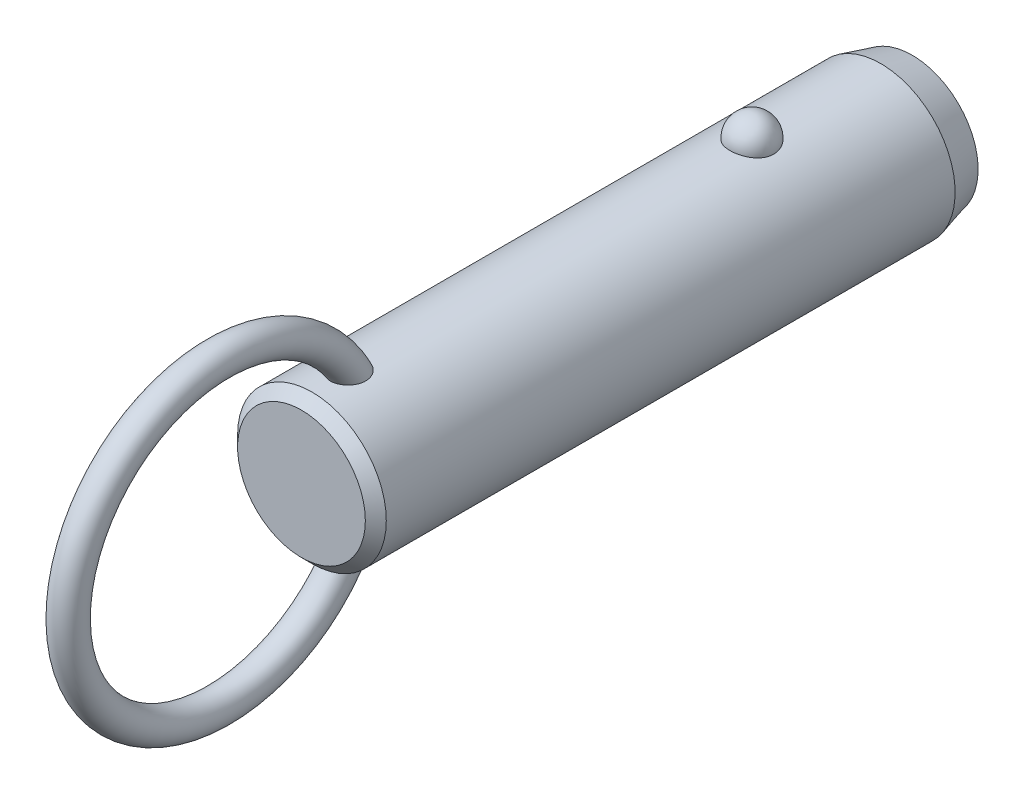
ISO-10303-21;
HEADER;
FILE_DESCRIPTION(('STEP AP214'),'2;1');
FILE_NAME('part.step','',(''),(''),'','','');
FILE_SCHEMA(('AUTOMOTIVE_DESIGN { 1 0 10303 214 1 1 1 1 }'));
ENDSEC;
DATA;
#1=APPLICATION_CONTEXT('core data for automotive mechanical design processes');
#2=APPLICATION_PROTOCOL_DEFINITION('international standard','automotive_design',2000,#1);
#3=PRODUCT_CONTEXT('',#1,'mechanical');
#4=PRODUCT('Part','Part','',(#3));
#5=PRODUCT_RELATED_PRODUCT_CATEGORY('part','',(#4));
#6=PRODUCT_DEFINITION_FORMATION('','',#4);
#7=PRODUCT_DEFINITION_CONTEXT('part definition',#1,'design');
#8=PRODUCT_DEFINITION('design','',#6,#7);
#9=PRODUCT_DEFINITION_SHAPE('','',#8);
#10=(LENGTH_UNIT() NAMED_UNIT(*) SI_UNIT(.MILLI.,.METRE.));
#11=(NAMED_UNIT(*) PLANE_ANGLE_UNIT() SI_UNIT($,.RADIAN.));
#12=(NAMED_UNIT(*) SI_UNIT($,.STERADIAN.) SOLID_ANGLE_UNIT());
#13=UNCERTAINTY_MEASURE_WITH_UNIT(LENGTH_MEASURE(1.E-05),#10,'distance_accuracy_value','');
#14=(GEOMETRIC_REPRESENTATION_CONTEXT(3) GLOBAL_UNCERTAINTY_ASSIGNED_CONTEXT((#13)) GLOBAL_UNIT_ASSIGNED_CONTEXT((#10,
#11,#12)) REPRESENTATION_CONTEXT('',''));
#15=CARTESIAN_POINT('',(0.,0.,0.));
#16=DIRECTION('',(0.,0.,1.));
#17=DIRECTION('',(1.,0.,0.));
#18=AXIS2_PLACEMENT_3D('',#15,#16,#17);
#19=CARTESIAN_POINT('',(0.,0.,33.));
#20=DIRECTION('',(0.,0.,-1.));
#21=DIRECTION('',(-1.,0.,0.));
#22=AXIS2_PLACEMENT_3D('',#19,#20,#21);
#23=CYLINDRICAL_SURFACE('',#22,7.1);
#24=CARTESIAN_POINT('',(2.0769088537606,6.78943661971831,-2.1));
#25=CARTESIAN_POINT('',(2.07690739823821,6.78943796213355,-1.98268154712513));
#26=CARTESIAN_POINT('',(2.06738130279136,6.79237331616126,-1.86534506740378));
#27=CARTESIAN_POINT('',(2.0295040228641,6.8037853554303,-1.63400788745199));
#28=CARTESIAN_POINT('',(2.00114757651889,6.81226358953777,-1.52000812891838));
#29=CARTESIAN_POINT('',(1.92632025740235,6.83379798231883,-1.29863433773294));
#30=CARTESIAN_POINT('',(1.87985726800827,6.84685214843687,-1.19125744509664));
#31=CARTESIAN_POINT('',(1.76995205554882,6.87608091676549,-0.98604657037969));
#32=CARTESIAN_POINT('',(1.70650980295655,6.8922555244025,-0.88821260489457));
#33=CARTESIAN_POINT('',(1.5638119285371,6.92602930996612,-0.704242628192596));
#34=CARTESIAN_POINT('',(1.4844714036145,6.94363582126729,-0.618173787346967));
#35=CARTESIAN_POINT('',(1.31221746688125,6.97823658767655,-0.460740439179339));
#36=CARTESIAN_POINT('',(1.21930409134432,6.99523084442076,-0.389375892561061));
#37=CARTESIAN_POINT('',(1.02268781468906,7.02666176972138,-0.263547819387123));
#38=CARTESIAN_POINT('',(0.91902009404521,7.04110638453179,-0.209031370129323));
#39=CARTESIAN_POINT('',(0.703548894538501,7.06588726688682,-0.118163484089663));
#40=CARTESIAN_POINT('',(0.591746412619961,7.07622403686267,-0.0818098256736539));
#41=CARTESIAN_POINT('',(0.365557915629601,7.09147068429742,-0.0288711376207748));
#42=CARTESIAN_POINT('',(0.251267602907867,7.09648447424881,-0.0119070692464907));
#43=CARTESIAN_POINT('',(0.0213499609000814,7.10089837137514,0.00304925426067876));
#44=CARTESIAN_POINT('',(-0.0942772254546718,7.10029907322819,0.00104351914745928));
#45=CARTESIAN_POINT('',(-0.321651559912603,7.09360829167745,-0.0216931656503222));
#46=CARTESIAN_POINT('',(-0.433431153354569,7.08760388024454,-0.0421272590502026));
#47=CARTESIAN_POINT('',(-0.651862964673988,7.07086131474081,-0.100729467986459));
#48=CARTESIAN_POINT('',(-0.758515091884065,7.06012307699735,-0.138897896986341));
#49=CARTESIAN_POINT('',(-0.964449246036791,7.03496097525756,-0.232213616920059));
#50=CARTESIAN_POINT('',(-1.06368095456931,7.02051445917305,-0.287465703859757));
#51=CARTESIAN_POINT('',(-1.25145353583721,6.98948740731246,-0.413383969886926));
#52=CARTESIAN_POINT('',(-1.33999321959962,6.97290663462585,-0.48405186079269));
#53=CARTESIAN_POINT('',(-1.50591604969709,6.93898770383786,-0.640594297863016));
#54=CARTESIAN_POINT('',(-1.58302488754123,6.92164094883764,-0.726757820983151));
#55=CARTESIAN_POINT('',(-1.72189320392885,6.8884103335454,-0.91092752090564));
#56=CARTESIAN_POINT('',(-1.78365144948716,6.87252659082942,-1.008934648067));
#57=CARTESIAN_POINT('',(-1.89101272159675,6.84377189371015,-1.21549497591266));
#58=CARTESIAN_POINT('',(-1.93639553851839,6.83094274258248,-1.32416860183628));
#59=CARTESIAN_POINT('',(-2.00874275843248,6.81002070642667,-1.54791500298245));
#60=CARTESIAN_POINT('',(-2.03570774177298,6.80192767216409,-1.66298757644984));
#61=CARTESIAN_POINT('',(-2.07047276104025,6.7914266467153,-1.89571453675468));
#62=CARTESIAN_POINT('',(-2.07835878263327,6.78899315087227,-2.01335491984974));
#63=CARTESIAN_POINT('',(-2.07502083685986,6.79001409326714,-2.24833570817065));
#64=CARTESIAN_POINT('',(-2.06379746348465,6.7934683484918,-2.36567612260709));
#65=CARTESIAN_POINT('',(-2.02263913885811,6.80583442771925,-2.59603194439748));
#66=CARTESIAN_POINT('',(-1.99281127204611,6.81471501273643,-2.70906820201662));
#67=CARTESIAN_POINT('',(-1.91526639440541,6.83691232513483,-2.92836575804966));
#68=CARTESIAN_POINT('',(-1.8675486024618,6.85022924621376,-3.03462676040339));
#69=CARTESIAN_POINT('',(-1.75504492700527,6.87991336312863,-3.23806487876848));
#70=CARTESIAN_POINT('',(-1.69015924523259,6.89629822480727,-3.33518422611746));
#71=CARTESIAN_POINT('',(-1.54505404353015,6.93024852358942,-3.51697105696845));
#72=CARTESIAN_POINT('',(-1.46483385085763,6.94781401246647,-3.60163799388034));
#73=CARTESIAN_POINT('',(-1.29071406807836,6.98225977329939,-3.75654119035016));
#74=CARTESIAN_POINT('',(-1.19675650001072,6.99913673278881,-3.82671308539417));
#75=CARTESIAN_POINT('',(-0.997940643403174,7.03023618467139,-3.9501837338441));
#76=CARTESIAN_POINT('',(-0.89308318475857,7.04445887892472,-4.00348377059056));
#77=CARTESIAN_POINT('',(-0.676902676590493,7.06848365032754,-4.09107242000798));
#78=CARTESIAN_POINT('',(-0.565686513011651,7.0783430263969,-4.12560889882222));
#79=CARTESIAN_POINT('',(-0.338739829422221,7.09282534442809,-4.17575450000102));
#80=CARTESIAN_POINT('',(-0.223009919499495,7.09744899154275,-4.19136617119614));
#81=CARTESIAN_POINT('',(0.00707628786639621,7.10090930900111,-4.20307965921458));
#82=CARTESIAN_POINT('',(0.121410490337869,7.09986531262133,-4.19958377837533));
#83=CARTESIAN_POINT('',(0.347815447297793,7.092380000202,-4.17411564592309));
#84=CARTESIAN_POINT('',(0.459886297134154,7.08593891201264,-4.15214417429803));
#85=CARTESIAN_POINT('',(0.678084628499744,7.06838983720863,-4.09049562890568));
#86=CARTESIAN_POINT('',(0.784237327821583,7.05730369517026,-4.05090137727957));
#87=CARTESIAN_POINT('',(0.988305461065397,7.03163139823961,-3.95511447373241));
#88=CARTESIAN_POINT('',(1.08622031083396,7.01704499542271,-3.89892064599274));
#89=CARTESIAN_POINT('',(1.27284490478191,6.98562668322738,-3.77035541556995));
#90=CARTESIAN_POINT('',(1.36137372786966,6.96876135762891,-3.69772964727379));
#91=CARTESIAN_POINT('',(1.52509486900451,6.93477412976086,-3.53878279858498));
#92=CARTESIAN_POINT('',(1.60028496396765,6.91765218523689,-3.45245943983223));
#93=CARTESIAN_POINT('',(1.73681688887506,6.88465753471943,-3.26658774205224));
#94=CARTESIAN_POINT('',(1.79785966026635,6.86881574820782,-3.16681408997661));
#95=CARTESIAN_POINT('',(1.90265327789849,6.84053157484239,-2.95814408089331));
#96=CARTESIAN_POINT('',(1.94640861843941,6.82808830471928,-2.84925010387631));
#97=CARTESIAN_POINT('',(2.01274378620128,6.80881460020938,-2.63454318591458));
#98=CARTESIAN_POINT('',(2.03676193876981,6.80160856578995,-2.52920574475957));
#99=CARTESIAN_POINT('',(2.06884490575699,6.79191902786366,-2.3159172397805));
#100=CARTESIAN_POINT('',(2.07691019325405,6.78943538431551,-2.20796625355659));
#101=CARTESIAN_POINT('',(2.0769088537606,6.78943661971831,-2.1));
#102=B_SPLINE_CURVE_WITH_KNOTS('',3,(#24,#25,#26,#27,#28,#29,#30,#31,#32,#33,#34,#35,#36,#37,
#38,#39,#40,#41,#42,#43,#44,#45,#46,#47,#48,#49,#50,#51,#52,#53,#54,#55,#56,#57,#58,#59,#60,#61,
#62,#63,#64,#65,#66,#67,#68,#69,#70,#71,#72,#73,#74,#75,#76,#77,#78,#79,#80,#81,#82,#83,#84,#85,
#86,#87,#88,#89,#90,#91,#92,#93,#94,#95,#96,#97,#98,#99,#100,#101),.UNSPECIFIED.,.T.,.F.,(4,2,2,
2,2,2,2,2,2,2,2,2,2,2,2,2,2,2,2,2,2,2,2,2,2,2,2,2,2,2,2,2,2,2,2,2,2,2,4),(0.,0.351568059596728,
0.703234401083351,1.05474780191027,1.40626181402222,1.75970563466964,2.11314851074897,
2.4654696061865,2.81774759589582,3.16301449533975,3.50824481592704,3.84801136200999,
4.18778391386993,4.52968352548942,4.87162112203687,5.22076181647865,5.56993054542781,
5.92363364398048,6.27732559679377,6.62942052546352,6.98150450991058,7.33158042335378,
7.68167162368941,8.03384443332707,8.38603269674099,8.73975272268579,9.09344583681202,
9.44234545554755,9.79119807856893,10.1327344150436,10.4742563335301,10.8141898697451,
11.1541474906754,11.4997793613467,11.8454687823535,12.1979079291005,12.5502553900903,
12.8738073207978,13.1973496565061),.UNSPECIFIED.);
#103=CARTESIAN_POINT('',(2.0769088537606,6.78943661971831,-2.1));
#104=VERTEX_POINT('',#103);
#105=EDGE_CURVE('E41',#104,#104,#102,.T.);
#106=ORIENTED_EDGE('',*,*,#105,.T.);
#107=EDGE_LOOP('',(#106));
#108=FACE_BOUND('',#107,.T.);
#109=CARTESIAN_POINT('',(0.,0.,39.92));
#110=DIRECTION('',(0.,0.,1.));
#111=DIRECTION('',(1.,0.,0.));
#112=AXIS2_PLACEMENT_3D('',#109,#110,#111);
#113=CIRCLE('',#112,7.1);
#114=CARTESIAN_POINT('',(7.1,0.,39.92));
#115=VERTEX_POINT('',#114);
#116=EDGE_CURVE('E10',#115,#115,#113,.F.);
#117=ORIENTED_EDGE('',*,*,#116,.T.);
#118=EDGE_LOOP('',(#117));
#119=FACE_BOUND('',#118,.T.);
#120=CARTESIAN_POINT('',(-0.429539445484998,-7.08699541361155,34.7429212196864));
#121=CARTESIAN_POINT('',(-0.50833166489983,-7.08221999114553,34.7668764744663));
#122=CARTESIAN_POINT('',(-0.585039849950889,-7.07624016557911,34.7974570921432));
#123=CARTESIAN_POINT('',(-0.732082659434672,-7.06254296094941,34.8710242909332));
#124=CARTESIAN_POINT('',(-0.802417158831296,-7.05482554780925,34.9140111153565));
#125=CARTESIAN_POINT('',(-0.934722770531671,-7.03851844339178,35.0111135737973));
#126=CARTESIAN_POINT('',(-0.996700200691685,-7.02992941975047,35.0652207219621));
#127=CARTESIAN_POINT('',(-1.11079942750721,-7.01280697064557,35.1829676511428));
#128=CARTESIAN_POINT('',(-1.16292136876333,-7.00427354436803,35.2466072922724));
#129=CARTESIAN_POINT('',(-1.25705660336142,-6.98799959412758,35.3826870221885));
#130=CARTESIAN_POINT('',(-1.29888032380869,-6.98027525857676,35.4552598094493));
#131=CARTESIAN_POINT('',(-1.37069920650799,-6.96652886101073,35.6061686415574));
#132=CARTESIAN_POINT('',(-1.40069157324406,-6.96050720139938,35.6845060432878));
#133=CARTESIAN_POINT('',(-1.45043507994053,-6.95031881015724,35.8501903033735));
#134=CARTESIAN_POINT('',(-1.46937115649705,-6.94630231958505,35.9377897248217));
#135=CARTESIAN_POINT('',(-1.49424917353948,-6.94099239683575,36.1148714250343));
#136=CARTESIAN_POINT('',(-1.50018601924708,-6.93970003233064,36.2043544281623));
#137=CARTESIAN_POINT('',(-1.49978214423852,-6.93978815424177,36.3940607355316));
#138=CARTESIAN_POINT('',(-1.49187639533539,-6.94150934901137,36.494279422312));
#139=CARTESIAN_POINT('',(-1.46177925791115,-6.94790814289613,36.6924798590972));
#140=CARTESIAN_POINT('',(-1.43957541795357,-6.95258831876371,36.790459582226));
#141=CARTESIAN_POINT('',(-1.37783293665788,-6.96510647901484,36.9953629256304));
#142=CARTESIAN_POINT('',(-1.33634073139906,-6.97328848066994,37.1016801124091));
#143=CARTESIAN_POINT('',(-1.23686994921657,-6.99161706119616,37.3061777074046));
#144=CARTESIAN_POINT('',(-1.17889192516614,-7.00176357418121,37.4043583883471));
#145=CARTESIAN_POINT('',(-1.0587512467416,-7.02082898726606,37.5723743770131));
#146=CARTESIAN_POINT('',(-0.999247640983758,-7.02963746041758,37.6441230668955));
#147=CARTESIAN_POINT('',(-0.86949477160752,-7.04686074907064,37.7771959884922));
#148=CARTESIAN_POINT('',(-0.799263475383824,-7.05527619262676,37.8385372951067));
#149=CARTESIAN_POINT('',(-0.665408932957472,-7.06899457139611,37.9351316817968));
#150=CARTESIAN_POINT('',(-0.603817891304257,-7.07457275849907,37.9731512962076));
#151=CARTESIAN_POINT('',(-0.475172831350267,-7.08437420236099,38.0387581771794));
#152=CARTESIAN_POINT('',(-0.40812301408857,-7.08859848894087,38.0663533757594));
#153=CARTESIAN_POINT('',(-0.269431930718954,-7.09522749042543,38.1092569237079));
#154=CARTESIAN_POINT('',(-0.197757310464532,-7.09761688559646,38.1244618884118));
#155=CARTESIAN_POINT('',(-0.0527849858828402,-7.10017268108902,38.1407168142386));
#156=CARTESIAN_POINT('',(0.0205115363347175,-7.10034065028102,38.1417767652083));
#157=CARTESIAN_POINT('',(0.156426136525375,-7.09855986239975,38.1304619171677));
#158=CARTESIAN_POINT('',(0.219199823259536,-7.09688191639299,38.1198060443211));
#159=CARTESIAN_POINT('',(0.342134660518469,-7.09201880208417,38.0885379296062));
#160=CARTESIAN_POINT('',(0.402295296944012,-7.08883333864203,38.0679237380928));
#161=CARTESIAN_POINT('',(0.520687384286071,-7.08113868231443,38.0172125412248));
#162=CARTESIAN_POINT('',(0.578791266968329,-7.07658958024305,37.9868272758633));
#163=CARTESIAN_POINT('',(0.690173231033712,-7.06659708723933,37.9183678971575));
#164=CARTESIAN_POINT('',(0.743447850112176,-7.061153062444,37.8802883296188));
#165=CARTESIAN_POINT('',(0.870947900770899,-7.04680292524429,37.7765929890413));
#166=CARTESIAN_POINT('',(0.941828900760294,-7.0375580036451,37.7068972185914));
#167=CARTESIAN_POINT('',(1.07136606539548,-7.01900793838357,37.5569450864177));
#168=CARTESIAN_POINT('',(1.13000013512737,-7.00970271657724,37.4766700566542));
#169=CARTESIAN_POINT('',(1.23579584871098,-6.99183327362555,37.3068997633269));
#170=CARTESIAN_POINT('',(1.2827427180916,-6.98328455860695,37.2172696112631));
#171=CARTESIAN_POINT('',(1.36351442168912,-6.96796352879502,37.0321763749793));
#172=CARTESIAN_POINT('',(1.39733971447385,-6.96119115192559,36.9367134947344));
#173=CARTESIAN_POINT('',(1.45579181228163,-6.94922464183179,36.7253092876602));
#174=CARTESIAN_POINT('',(1.47790145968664,-6.94449000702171,36.608631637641));
#175=CARTESIAN_POINT('',(1.50168752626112,-6.93938731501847,36.3730153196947));
#176=CARTESIAN_POINT('',(1.50336085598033,-6.93901991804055,36.2540763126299));
#177=CARTESIAN_POINT('',(1.48486516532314,-6.9430010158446,36.0236079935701));
#178=CARTESIAN_POINT('',(1.46573441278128,-6.9471253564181,35.911995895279));
#179=CARTESIAN_POINT('',(1.40606892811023,-6.95944667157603,35.6948868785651));
#180=CARTESIAN_POINT('',(1.36556446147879,-6.96763788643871,35.5893815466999));
#181=CARTESIAN_POINT('',(1.27082700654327,-6.98548038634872,35.4042879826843));
#182=CARTESIAN_POINT('',(1.21949810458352,-6.99473841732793,35.3231719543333));
#183=CARTESIAN_POINT('',(1.10242050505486,-7.01414069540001,35.1722278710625));
#184=CARTESIAN_POINT('',(1.03668119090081,-7.02428436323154,35.1023925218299));
#185=CARTESIAN_POINT('',(0.90055902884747,-7.04295285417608,34.9835735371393));
#186=CARTESIAN_POINT('',(0.831428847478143,-7.05153466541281,34.9331573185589));
#187=CARTESIAN_POINT('',(0.685291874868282,-7.06723150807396,34.8451429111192));
#188=CARTESIAN_POINT('',(0.608287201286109,-7.0743469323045,34.8075412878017));
#189=CARTESIAN_POINT('',(0.451878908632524,-7.08602232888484,34.7474915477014));
#190=CARTESIAN_POINT('',(0.372686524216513,-7.09067127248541,34.7245088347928));
#191=CARTESIAN_POINT('',(0.211477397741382,-7.09730788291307,34.6920357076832));
#192=CARTESIAN_POINT('',(0.129460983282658,-7.09929585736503,34.6825437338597));
#193=CARTESIAN_POINT('',(-0.0332905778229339,-7.10037858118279,34.6773517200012));
#194=CARTESIAN_POINT('',(-0.114016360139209,-7.09953334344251,34.6813656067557));
#195=CARTESIAN_POINT('',(-0.273670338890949,-7.09517338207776,34.7024540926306));
#196=CARTESIAN_POINT('',(-0.352598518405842,-7.09165863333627,34.7195288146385));
#197=CARTESIAN_POINT('',(-0.429539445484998,-7.08699541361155,34.7429212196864));
#198=B_SPLINE_CURVE_WITH_KNOTS('',3,(#120,#121,#122,#123,#124,#125,#126,#127,#128,#129,#130,
#131,#132,#133,#134,#135,#136,#137,#138,#139,#140,#141,#142,#143,#144,#145,#146,#147,#148,#149,
#150,#151,#152,#153,#154,#155,#156,#157,#158,#159,#160,#161,#162,#163,#164,#165,#166,#167,#168,
#169,#170,#171,#172,#173,#174,#175,#176,#177,#178,#179,#180,#181,#182,#183,#184,#185,#186,#187,
#188,#189,#190,#191,#192,#193,#194,#195,#196,#197),.UNSPECIFIED.,.T.,.F.,(4,2,2,2,2,2,2,2,2,2,2,
2,2,2,2,2,2,2,2,2,2,2,2,2,2,2,2,2,2,2,2,2,2,2,2,2,2,2,4),(0.,0.247183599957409,
0.494372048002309,0.741372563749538,0.98836945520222,1.23962059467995,1.49093106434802,
1.75897818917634,2.02713035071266,2.32758265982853,2.62829697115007,2.9700873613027,
3.31186629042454,3.5917531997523,3.87117637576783,4.08813841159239,4.30493502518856,
4.52352259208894,4.74195577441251,4.93215328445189,5.12238804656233,5.31884850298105,
5.51544871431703,5.8133231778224,6.11173048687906,6.41527266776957,6.7188042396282,
7.07358156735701,7.42841252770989,7.76631485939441,8.10373999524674,8.39142246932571,
8.67891817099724,8.93560332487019,9.19221962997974,9.43881106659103,9.68537399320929,
9.92674752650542,10.1681233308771),.UNSPECIFIED.);
#199=CARTESIAN_POINT('',(-0.429539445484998,-7.08699541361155,34.7429212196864));
#200=VERTEX_POINT('',#199);
#201=EDGE_CURVE('E60',#200,#200,#198,.T.);
#202=ORIENTED_EDGE('',*,*,#201,.T.);
#203=EDGE_LOOP('',(#202));
#204=FACE_BOUND('',#203,.T.);
#205=CARTESIAN_POINT('',(-0.429539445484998,7.08699541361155,34.7429212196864));
#206=CARTESIAN_POINT('',(-0.351665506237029,7.09171429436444,34.7192469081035));
#207=CARTESIAN_POINT('',(-0.271733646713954,7.09525896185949,34.7020369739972));
#208=CARTESIAN_POINT('',(-0.110026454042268,7.09960839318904,34.6810059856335));
#209=CARTESIAN_POINT('',(-0.0282502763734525,7.10041187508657,34.677191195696));
#210=CARTESIAN_POINT('',(0.134782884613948,7.09918849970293,34.683059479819));
#211=CARTESIAN_POINT('',(0.216039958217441,7.09716214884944,34.6927401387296));
#212=CARTESIAN_POINT('',(0.375730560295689,7.09050177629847,34.7253471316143));
#213=CARTESIAN_POINT('',(0.454164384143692,7.08586802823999,34.7482720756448));
#214=CARTESIAN_POINT('',(0.606025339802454,7.07449911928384,34.806771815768));
#215=CARTESIAN_POINT('',(0.679451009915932,7.06776334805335,34.8423502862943));
#216=CARTESIAN_POINT('',(0.819234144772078,7.05292866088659,34.9251753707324));
#217=CARTESIAN_POINT('',(0.885591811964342,7.04482978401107,34.9724216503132));
#218=CARTESIAN_POINT('',(1.00993211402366,7.02808709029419,35.0775902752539));
#219=CARTESIAN_POINT('',(1.06785399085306,7.01943990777,35.135583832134));
#220=CARTESIAN_POINT('',(1.17342527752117,7.00256662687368,35.2603013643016));
#221=CARTESIAN_POINT('',(1.22107408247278,6.99434055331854,35.3270258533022));
#222=CARTESIAN_POINT('',(1.30652927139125,6.97889183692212,35.4693622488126));
#223=CARTESIAN_POINT('',(1.34399711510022,6.97170674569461,35.5451808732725));
#224=CARTESIAN_POINT('',(1.40682616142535,6.95930080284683,35.7018100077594));
#225=CARTESIAN_POINT('',(1.43218374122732,6.95408053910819,35.7826220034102));
#226=CARTESIAN_POINT('',(1.47246409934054,6.94566853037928,35.9535314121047));
#227=CARTESIAN_POINT('',(1.48642590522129,6.9426653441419,36.0438630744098));
#228=CARTESIAN_POINT('',(1.5011410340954,6.93949744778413,36.225619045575));
#229=CARTESIAN_POINT('',(1.50188917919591,6.93933385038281,36.3170437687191));
#230=CARTESIAN_POINT('',(1.49030464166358,6.94183245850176,36.5108438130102));
#231=CARTESIAN_POINT('',(1.47627413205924,6.94486147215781,36.613112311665));
#232=CARTESIAN_POINT('',(1.43356351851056,6.95380194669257,36.8144719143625));
#233=CARTESIAN_POINT('',(1.4048676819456,6.95971650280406,36.9135594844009));
#234=CARTESIAN_POINT('',(1.32908750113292,6.97461208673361,37.1189087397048));
#235=CARTESIAN_POINT('',(1.28011435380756,6.98388945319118,37.2244566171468));
#236=CARTESIAN_POINT('',(1.16520357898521,7.00397743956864,37.4257604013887));
#237=CARTESIAN_POINT('',(1.09927694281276,7.01478706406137,37.5215225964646));
#238=CARTESIAN_POINT('',(0.969361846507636,7.03373936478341,37.6767565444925));
#239=CARTESIAN_POINT('',(0.909042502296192,7.04187023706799,37.7393032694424));
#240=CARTESIAN_POINT('',(0.779178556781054,7.05741732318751,37.8540535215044));
#241=CARTESIAN_POINT('',(0.709649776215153,7.06483472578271,37.9062744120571));
#242=CARTESIAN_POINT('',(0.576854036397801,7.0767751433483,37.9881138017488));
#243=CARTESIAN_POINT('',(0.515118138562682,7.08158033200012,38.0201641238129));
#244=CARTESIAN_POINT('',(0.387127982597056,7.08972701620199,38.0737656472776));
#245=CARTESIAN_POINT('',(0.320877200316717,7.09306962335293,38.0953248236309));
#246=CARTESIAN_POINT('',(0.185041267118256,7.09791507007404,38.1264005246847));
#247=CARTESIAN_POINT('',(0.115437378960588,7.09940591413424,38.1358385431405));
#248=CARTESIAN_POINT('',(-0.0243157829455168,7.10030171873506,38.1415226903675));
#249=CARTESIAN_POINT('',(-0.094464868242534,7.0997073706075,38.1377731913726));
#250=CARTESIAN_POINT('',(-0.225713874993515,7.09668414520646,38.1185081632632));
#251=CARTESIAN_POINT('',(-0.287006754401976,7.09444865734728,38.1042323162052));
#252=CARTESIAN_POINT('',(-0.406555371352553,7.08860360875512,38.0663685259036));
#253=CARTESIAN_POINT('',(-0.464809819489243,7.08499346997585,38.0427766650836));
#254=CARTESIAN_POINT('',(-0.594955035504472,7.07541654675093,37.9789232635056));
#255=CARTESIAN_POINT('',(-0.665389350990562,7.06906574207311,37.935753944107));
#256=CARTESIAN_POINT('',(-0.798242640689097,7.05530261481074,37.838587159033));
#257=CARTESIAN_POINT('',(-0.860645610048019,7.0478882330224,37.7845686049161));
#258=CARTESIAN_POINT('',(-0.99424943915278,7.03045217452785,37.6509965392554));
#259=CARTESIAN_POINT('',(-1.06260129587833,7.02030745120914,37.5686143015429));
#260=CARTESIAN_POINT('',(-1.18502045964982,7.00068382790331,37.393843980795));
#261=CARTESIAN_POINT('',(-1.239076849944,6.99120544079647,37.301448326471));
#262=CARTESIAN_POINT('',(-1.33335589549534,6.97384343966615,37.1080085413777));
#263=CARTESIAN_POINT('',(-1.3733613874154,6.96598557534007,37.0068564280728));
#264=CARTESIAN_POINT('',(-1.43770677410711,6.9529905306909,36.7995046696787));
#265=CARTESIAN_POINT('',(-1.46204473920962,6.94785368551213,36.69330440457));
#266=CARTESIAN_POINT('',(-1.49537533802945,6.94076296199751,36.468231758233));
#267=CARTESIAN_POINT('',(-1.50273564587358,6.93914842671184,36.3490975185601));
#268=CARTESIAN_POINT('',(-1.4954555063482,6.94072368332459,36.1114703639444));
#269=CARTESIAN_POINT('',(-1.48082914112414,6.94391040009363,35.9929770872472));
#270=CARTESIAN_POINT('',(-1.43076401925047,6.95438579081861,35.7734325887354));
#271=CARTESIAN_POINT('',(-1.39762227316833,6.96121852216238,35.6718413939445));
#272=CARTESIAN_POINT('',(-1.31211274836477,6.97783941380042,35.4773513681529));
#273=CARTESIAN_POINT('',(-1.25976607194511,6.98762432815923,35.3844431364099));
#274=CARTESIAN_POINT('',(-1.14583073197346,7.00713153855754,35.2241601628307));
#275=CARTESIAN_POINT('',(-1.08665947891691,7.01665982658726,35.1550351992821));
#276=CARTESIAN_POINT('',(-0.956606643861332,7.03556646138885,35.0288786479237));
#277=CARTESIAN_POINT('',(-0.885737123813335,7.04494495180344,34.9718347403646));
#278=CARTESIAN_POINT('',(-0.751558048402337,7.06035735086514,34.8831004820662));
#279=CARTESIAN_POINT('',(-0.690120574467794,7.0666695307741,34.8485932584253));
#280=CARTESIAN_POINT('',(-0.562815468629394,7.07794609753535,34.7887507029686));
#281=CARTESIAN_POINT('',(-0.496948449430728,7.08291067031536,34.7634141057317));
#282=CARTESIAN_POINT('',(-0.429539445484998,7.08699541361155,34.7429212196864));
#283=B_SPLINE_CURVE_WITH_KNOTS('',3,(#205,#206,#207,#208,#209,#210,#211,#212,#213,#214,#215,
#216,#217,#218,#219,#220,#221,#222,#223,#224,#225,#226,#227,#228,#229,#230,#231,#232,#233,#234,
#235,#236,#237,#238,#239,#240,#241,#242,#243,#244,#245,#246,#247,#248,#249,#250,#251,#252,#253,
#254,#255,#256,#257,#258,#259,#260,#261,#262,#263,#264,#265,#266,#267,#268,#269,#270,#271,#272,
#273,#274,#275,#276,#277,#278,#279,#280,#281,#282),.UNSPECIFIED.,.T.,.F.,(4,2,2,2,2,2,2,2,2,2,2,
2,2,2,2,2,2,2,2,2,2,2,2,2,2,2,2,2,2,2,2,2,2,2,2,2,2,2,4),(0.,0.244335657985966,
0.488785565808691,0.733191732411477,0.977572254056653,1.22202379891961,1.46646834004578,
1.71259457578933,1.9587352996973,2.21226768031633,2.46587585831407,2.73913816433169,
3.01250754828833,3.32109936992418,3.63002293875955,3.97863512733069,4.32702187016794,
4.58793945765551,4.84841449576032,5.05676704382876,5.26496096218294,5.47449661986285,
5.68396281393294,5.87205447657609,6.06022532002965,6.30743751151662,6.55513496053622,
6.87602468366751,7.19715875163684,7.52305774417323,7.84899686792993,8.20516155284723,
8.5610982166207,8.88040084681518,9.19935367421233,9.47236282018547,9.74509220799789,
9.95662250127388,10.1681235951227),.UNSPECIFIED.);
#284=CARTESIAN_POINT('',(-0.429539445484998,7.08699541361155,34.7429212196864));
#285=VERTEX_POINT('',#284);
#286=EDGE_CURVE('E67',#285,#285,#283,.T.);
#287=ORIENTED_EDGE('',*,*,#286,.T.);
#288=EDGE_LOOP('',(#287));
#289=FACE_BOUND('',#288,.T.);
#290=CARTESIAN_POINT('',(0.,0.,-14.4));
#291=DIRECTION('',(0.,0.,-1.));
#292=DIRECTION('',(-1.,0.,0.));
#293=AXIS2_PLACEMENT_3D('',#290,#291,#292);
#294=CIRCLE('',#293,7.1);
#295=CARTESIAN_POINT('',(-7.1,0.,-14.4));
#296=VERTEX_POINT('',#295);
#297=EDGE_CURVE('E57',#296,#296,#294,.F.);
#298=ORIENTED_EDGE('',*,*,#297,.T.);
#299=EDGE_LOOP('',(#298));
#300=FACE_BOUND('',#299,.T.);
#301=ADVANCED_FACE('F37',(#108,#119,#204,#289,#300),#23,.T.);
#302=CARTESIAN_POINT('',(0.,0.,-17.4));
#303=DIRECTION('',(0.,0.,-1.));
#304=DIRECTION('',(-1.,0.,0.));
#305=AXIS2_PLACEMENT_3D('',#302,#303,#304);
#306=PLANE('',#305);
#307=CARTESIAN_POINT('',(0.,0.,-17.4));
#308=DIRECTION('',(0.,0.,-1.));
#309=DIRECTION('',(-1.,0.,0.));
#310=AXIS2_PLACEMENT_3D('',#307,#308,#309);
#311=CIRCLE('',#310,6.29615242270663);
#312=CARTESIAN_POINT('',(-6.29615242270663,0.,-17.4));
#313=VERTEX_POINT('',#312);
#314=EDGE_CURVE('E66',#313,#313,#311,.T.);
#315=ORIENTED_EDGE('',*,*,#314,.T.);
#316=EDGE_LOOP('',(#315));
#317=FACE_BOUND('',#316,.T.);
#318=ADVANCED_FACE('F85',(#317),#306,.T.);
#319=CARTESIAN_POINT('',(0.,0.,-17.4));
#320=DIRECTION('',(0.,0.,1.));
#321=DIRECTION('',(1.,0.,0.));
#322=AXIS2_PLACEMENT_3D('',#319,#320,#321);
#323=CONICAL_SURFACE('',#322,6.29615242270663,0.261799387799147);
#324=ORIENTED_EDGE('',*,*,#297,.F.);
#325=EDGE_LOOP('',(#324));
#326=FACE_BOUND('',#325,.T.);
#327=ORIENTED_EDGE('',*,*,#314,.F.);
#328=EDGE_LOOP('',(#327));
#329=FACE_BOUND('',#328,.T.);
#330=ADVANCED_FACE('F83',(#326,#329),#323,.T.);
#331=CARTESIAN_POINT('',(0.,0.,40.92));
#332=DIRECTION('',(0.,0.,1.));
#333=DIRECTION('',(1.,0.,0.));
#334=AXIS2_PLACEMENT_3D('',#331,#332,#333);
#335=PLANE('',#334);
#336=CARTESIAN_POINT('',(0.,0.,40.92));
#337=DIRECTION('',(0.,0.,1.));
#338=DIRECTION('',(1.,0.,0.));
#339=AXIS2_PLACEMENT_3D('',#336,#337,#338);
#340=CIRCLE('',#339,6.10000000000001);
#341=CARTESIAN_POINT('',(6.10000000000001,0.,40.92));
#342=VERTEX_POINT('',#341);
#343=EDGE_CURVE('E50',#342,#342,#340,.T.);
#344=ORIENTED_EDGE('',*,*,#343,.T.);
#345=EDGE_LOOP('',(#344));
#346=FACE_BOUND('',#345,.T.);
#347=ADVANCED_FACE('F77',(#346),#335,.T.);
#348=CARTESIAN_POINT('',(0.,0.,48.85));
#349=DIRECTION('',(1.,0.,0.));
#350=DIRECTION('',(0.,0.,-1.));
#351=AXIS2_PLACEMENT_3D('',#348,#349,#350);
#352=TOROIDAL_SURFACE('',#351,14.35,1.5);
#353=ORIENTED_EDGE('',*,*,#286,.F.);
#354=EDGE_LOOP('',(#353));
#355=FACE_BOUND('',#354,.T.);
#356=ORIENTED_EDGE('',*,*,#201,.F.);
#357=EDGE_LOOP('',(#356));
#358=FACE_BOUND('',#357,.T.);
#359=ADVANCED_FACE('F73',(#355,#358),#352,.T.);
#360=CARTESIAN_POINT('',(0.,0.,40.92));
#361=DIRECTION('',(0.,0.,-1.));
#362=DIRECTION('',(-1.,0.,0.));
#363=AXIS2_PLACEMENT_3D('',#360,#361,#362);
#364=CONICAL_SURFACE('',#363,6.10000000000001,0.785398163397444);
#365=ORIENTED_EDGE('',*,*,#116,.F.);
#366=EDGE_LOOP('',(#365));
#367=FACE_BOUND('',#366,.T.);
#368=ORIENTED_EDGE('',*,*,#343,.F.);
#369=EDGE_LOOP('',(#368));
#370=FACE_BOUND('',#369,.T.);
#371=ADVANCED_FACE('F39',(#367,#370),#364,.T.);
#372=CARTESIAN_POINT('',(0.,7.1,-2.1));
#373=DIRECTION('',(0.,1.,0.));
#374=DIRECTION('',(0.,0.,1.));
#375=AXIS2_PLACEMENT_3D('',#372,#373,#374);
#376=SPHERICAL_SURFACE('',#375,2.10000000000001);
#377=ORIENTED_EDGE('',*,*,#105,.F.);
#378=EDGE_LOOP('',(#377));
#379=FACE_BOUND('',#378,.T.);
#380=ADVANCED_FACE('F79',(#379),#376,.T.);
#381=CLOSED_SHELL('',(#301,#318,#330,#347,#359,#371,#380));
#382=MANIFOLD_SOLID_BREP('B2',#381);
#383=ADVANCED_BREP_SHAPE_REPRESENTATION('',(#18,#382),#14);
#384=SHAPE_DEFINITION_REPRESENTATION(#9,#383);
ENDSEC;
END-ISO-10303-21;
